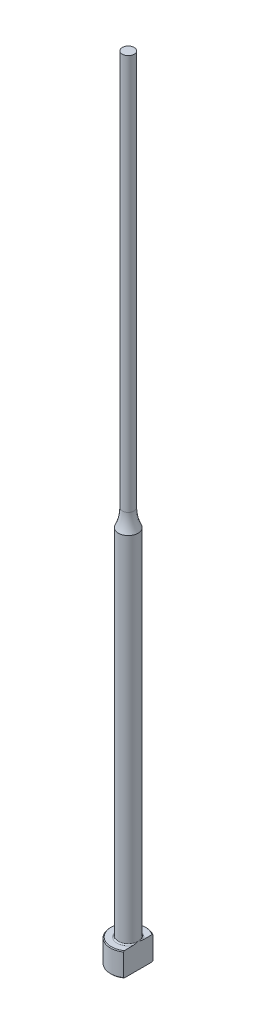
ISO-10303-21;
HEADER;
FILE_DESCRIPTION(('STEP AP214'),'2;1');
FILE_NAME('part.step','',(''),(''),'','','');
FILE_SCHEMA(('AUTOMOTIVE_DESIGN { 1 0 10303 214 1 1 1 1 }'));
ENDSEC;
DATA;
#1=APPLICATION_CONTEXT('core data for automotive mechanical design processes');
#2=APPLICATION_PROTOCOL_DEFINITION('international standard','automotive_design',2000,#1);
#3=PRODUCT_CONTEXT('',#1,'mechanical');
#4=PRODUCT('Part','Part','',(#3));
#5=PRODUCT_RELATED_PRODUCT_CATEGORY('part','',(#4));
#6=PRODUCT_DEFINITION_FORMATION('','',#4);
#7=PRODUCT_DEFINITION_CONTEXT('part definition',#1,'design');
#8=PRODUCT_DEFINITION('design','',#6,#7);
#9=PRODUCT_DEFINITION_SHAPE('','',#8);
#10=(LENGTH_UNIT() NAMED_UNIT(*) SI_UNIT(.MILLI.,.METRE.));
#11=(NAMED_UNIT(*) PLANE_ANGLE_UNIT() SI_UNIT($,.RADIAN.));
#12=(NAMED_UNIT(*) SI_UNIT($,.STERADIAN.) SOLID_ANGLE_UNIT());
#13=UNCERTAINTY_MEASURE_WITH_UNIT(LENGTH_MEASURE(1.E-05),#10,'distance_accuracy_value','');
#14=(GEOMETRIC_REPRESENTATION_CONTEXT(3) GLOBAL_UNCERTAINTY_ASSIGNED_CONTEXT((#13)) GLOBAL_UNIT_ASSIGNED_CONTEXT((#10,
#11,#12)) REPRESENTATION_CONTEXT('',''));
#15=CARTESIAN_POINT('',(0.,0.,0.));
#16=DIRECTION('',(0.,0.,1.));
#17=DIRECTION('',(1.,0.,0.));
#18=AXIS2_PLACEMENT_3D('',#15,#16,#17);
#19=CARTESIAN_POINT('',(-4.49999999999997,6.,0.));
#20=DIRECTION('',(0.,1.,0.));
#21=DIRECTION('',(0.,0.,1.));
#22=AXIS2_PLACEMENT_3D('',#19,#20,#21);
#23=PLANE('',#22);
#24=CARTESIAN_POINT('',(0.,6.,0.));
#25=DIRECTION('',(0.,1.,0.));
#26=DIRECTION('',(0.,0.,1.));
#27=AXIS2_PLACEMENT_3D('',#24,#25,#26);
#28=CIRCLE('',#27,4.3);
#29=CARTESIAN_POINT('',(2.49999999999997,6.,-3.49857113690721));
#30=VERTEX_POINT('',#29);
#31=CARTESIAN_POINT('',(2.49999999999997,6.,3.49857113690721));
#32=VERTEX_POINT('',#31);
#33=EDGE_CURVE('E187',#30,#32,#28,.T.);
#34=ORIENTED_EDGE('',*,*,#33,.T.);
#35=DIRECTION('',(0.,0.,-1.));
#36=VECTOR('',#35,1.);
#37=CARTESIAN_POINT('',(2.49999999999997,6.,0.));
#38=LINE('',#37,#36);
#39=CARTESIAN_POINT('',(2.49999999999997,5.99999999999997,1.26095202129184));
#40=VERTEX_POINT('',#39);
#41=EDGE_CURVE('E57',#32,#40,#38,.T.);
#42=ORIENTED_EDGE('',*,*,#41,.T.);
#43=CARTESIAN_POINT('',(0.,6.,0.));
#44=DIRECTION('',(0.,1.,0.));
#45=DIRECTION('',(0.,0.,1.));
#46=AXIS2_PLACEMENT_3D('',#43,#44,#45);
#47=CIRCLE('',#46,2.79999999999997);
#48=CARTESIAN_POINT('',(2.49999999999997,5.99999999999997,-1.26095202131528));
#49=VERTEX_POINT('',#48);
#50=EDGE_CURVE('E108',#40,#49,#47,.F.);
#51=ORIENTED_EDGE('',*,*,#50,.T.);
#52=EDGE_CURVE('E137',#49,#30,#38,.T.);
#53=ORIENTED_EDGE('',*,*,#52,.T.);
#54=EDGE_LOOP('',(#34,#42,#51,#53));
#55=FACE_BOUND('',#54,.T.);
#56=ADVANCED_FACE('F32',(#55),#23,.T.);
#57=CARTESIAN_POINT('',(0.,259.958771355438,0.));
#58=DIRECTION('',(0.,1.,0.));
#59=DIRECTION('',(0.,0.,1.));
#60=AXIS2_PLACEMENT_3D('',#57,#58,#59);
#61=CYLINDRICAL_SURFACE('',#60,4.49999999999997);
#62=CARTESIAN_POINT('',(0.,5.80000000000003,0.));
#63=DIRECTION('',(0.,1.,0.));
#64=DIRECTION('',(0.,0.,1.));
#65=AXIS2_PLACEMENT_3D('',#62,#63,#64);
#66=CIRCLE('',#65,4.49999999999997);
#67=CARTESIAN_POINT('',(2.49999999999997,5.80000000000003,3.74165738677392));
#68=VERTEX_POINT('',#67);
#69=CARTESIAN_POINT('',(2.49999999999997,5.80000000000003,-3.74165738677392));
#70=VERTEX_POINT('',#69);
#71=EDGE_CURVE('E105',#68,#70,#66,.F.);
#72=ORIENTED_EDGE('',*,*,#71,.T.);
#73=DIRECTION('',(0.,-1.,0.));
#74=VECTOR('',#73,1.);
#75=CARTESIAN_POINT('',(2.49999999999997,200.,-3.74165738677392));
#76=LINE('',#75,#74);
#77=CARTESIAN_POINT('',(2.49999999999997,0.200000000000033,-3.74165738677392));
#78=VERTEX_POINT('',#77);
#79=EDGE_CURVE('E193',#70,#78,#76,.T.);
#80=ORIENTED_EDGE('',*,*,#79,.T.);
#81=CARTESIAN_POINT('',(0.,0.200000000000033,0.));
#82=DIRECTION('',(0.,-1.,0.));
#83=DIRECTION('',(0.,0.,-1.));
#84=AXIS2_PLACEMENT_3D('',#81,#82,#83);
#85=CIRCLE('',#84,4.49999999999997);
#86=CARTESIAN_POINT('',(2.49999999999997,0.200000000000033,3.74165738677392));
#87=VERTEX_POINT('',#86);
#88=EDGE_CURVE('E100',#78,#87,#85,.F.);
#89=ORIENTED_EDGE('',*,*,#88,.T.);
#90=DIRECTION('',(0.,-1.,0.));
#91=VECTOR('',#90,1.);
#92=CARTESIAN_POINT('',(2.49999999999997,200.,3.74165738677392));
#93=LINE('',#92,#91);
#94=EDGE_CURVE('E93',#68,#87,#93,.T.);
#95=ORIENTED_EDGE('',*,*,#94,.F.);
#96=EDGE_LOOP('',(#72,#80,#89,#95));
#97=FACE_BOUND('',#96,.T.);
#98=ADVANCED_FACE('F158',(#97),#61,.T.);
#99=CARTESIAN_POINT('',(0.,0.,0.));
#100=DIRECTION('',(0.,-1.,0.));
#101=DIRECTION('',(0.,0.,-1.));
#102=AXIS2_PLACEMENT_3D('',#99,#100,#101);
#103=PLANE('',#102);
#104=CARTESIAN_POINT('',(0.,0.,0.));
#105=DIRECTION('',(0.,-1.,0.));
#106=DIRECTION('',(0.,0.,-1.));
#107=AXIS2_PLACEMENT_3D('',#104,#105,#106);
#108=CIRCLE('',#107,4.29999999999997);
#109=CARTESIAN_POINT('',(2.49999999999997,0.,3.49857113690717));
#110=VERTEX_POINT('',#109);
#111=CARTESIAN_POINT('',(2.49999999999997,0.,-3.49857113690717));
#112=VERTEX_POINT('',#111);
#113=EDGE_CURVE('E98',#110,#112,#108,.T.);
#114=ORIENTED_EDGE('',*,*,#113,.T.);
#115=DIRECTION('',(0.,0.,1.));
#116=VECTOR('',#115,1.);
#117=CARTESIAN_POINT('',(2.49999999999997,0.,3.74165738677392));
#118=LINE('',#117,#116);
#119=EDGE_CURVE('E83',#112,#110,#118,.T.);
#120=ORIENTED_EDGE('',*,*,#119,.T.);
#121=EDGE_LOOP('',(#114,#120));
#122=FACE_BOUND('',#121,.T.);
#123=ADVANCED_FACE('F103',(#122),#103,.T.);
#124=CARTESIAN_POINT('',(0.,6.00000000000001,0.));
#125=DIRECTION('',(0.,-1.,0.));
#126=DIRECTION('',(0.,0.,-1.));
#127=AXIS2_PLACEMENT_3D('',#124,#125,#126);
#128=CONICAL_SURFACE('',#127,4.3,0.785398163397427);
#129=ORIENTED_EDGE('',*,*,#71,.F.);
#130=CARTESIAN_POINT('',(2.49999999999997,1.69536803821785,8.233449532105));
#131=CARTESIAN_POINT('',(2.49999999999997,1.8415955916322,8.08062583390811));
#132=CARTESIAN_POINT('',(2.49999999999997,1.9876479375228,7.92763429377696));
#133=CARTESIAN_POINT('',(2.49999999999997,2.27932845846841,7.6212454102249));
#134=CARTESIAN_POINT('',(2.49999999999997,2.42495663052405,7.46784806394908));
#135=CARTESIAN_POINT('',(2.49999999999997,2.86116481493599,7.00686753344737));
#136=CARTESIAN_POINT('',(2.49999999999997,3.15099433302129,6.69857321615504));
#137=CARTESIAN_POINT('',(2.49999999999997,3.72884985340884,6.07807253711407));
#138=CARTESIAN_POINT('',(2.49999999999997,4.01686464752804,5.76585569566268));
#139=CARTESIAN_POINT('',(2.49999999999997,4.44539957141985,5.29439081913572));
#140=CARTESIAN_POINT('',(2.49999999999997,4.58765535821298,5.13672163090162));
#141=CARTESIAN_POINT('',(2.49999999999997,4.87066186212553,4.82003964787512));
#142=CARTESIAN_POINT('',(2.49999999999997,5.01141259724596,4.66102686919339));
#143=CARTESIAN_POINT('',(2.49999999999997,5.2957078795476,4.335826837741));
#144=CARTESIAN_POINT('',(2.49999999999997,5.43918418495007,4.16957975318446));
#145=CARTESIAN_POINT('',(2.49999999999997,5.72327592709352,3.83461659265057));
#146=CARTESIAN_POINT('',(2.49999999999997,5.86389099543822,3.66590020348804));
#147=CARTESIAN_POINT('',(2.49999999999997,6.14107420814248,3.32513857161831));
#148=CARTESIAN_POINT('',(2.49999999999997,6.27764223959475,3.15309323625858));
#149=CARTESIAN_POINT('',(2.49999999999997,6.47795110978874,2.89156777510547));
#150=CARTESIAN_POINT('',(2.49999999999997,6.5439576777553,2.80382460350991));
#151=CARTESIAN_POINT('',(2.49999999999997,6.67408242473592,2.62695176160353));
#152=CARTESIAN_POINT('',(2.49999999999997,6.73820069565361,2.53782215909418));
#153=CARTESIAN_POINT('',(2.49999999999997,6.87152528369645,2.34725612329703));
#154=CARTESIAN_POINT('',(2.49999999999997,6.94043579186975,2.24561149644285));
#155=CARTESIAN_POINT('',(2.49999999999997,7.07436956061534,2.03980429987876));
#156=CARTESIAN_POINT('',(2.49999999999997,7.13939350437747,1.93564217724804));
#157=CARTESIAN_POINT('',(2.49999999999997,7.26425850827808,1.72423874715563));
#158=CARTESIAN_POINT('',(2.49999999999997,7.32410048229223,1.61699798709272));
#159=CARTESIAN_POINT('',(2.49999999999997,7.43673687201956,1.39892979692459));
#160=CARTESIAN_POINT('',(2.49999999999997,7.48953435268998,1.28810395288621));
#161=CARTESIAN_POINT('',(2.49999999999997,7.60157711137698,1.02468144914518));
#162=CARTESIAN_POINT('',(2.49999999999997,7.65714985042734,0.870425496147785));
#163=CARTESIAN_POINT('',(2.49999999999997,7.72191807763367,0.634205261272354));
#164=CARTESIAN_POINT('',(2.49999999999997,7.74039604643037,0.55477398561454));
#165=CARTESIAN_POINT('',(2.49999999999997,7.77027635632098,0.39457073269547));
#166=CARTESIAN_POINT('',(2.49999999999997,7.78167951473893,0.313798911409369));
#167=CARTESIAN_POINT('',(2.49999999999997,7.79679993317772,0.150603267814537));
#168=CARTESIAN_POINT('',(2.49999999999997,7.8004286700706,0.0681710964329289));
#169=CARTESIAN_POINT('',(2.49999999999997,7.7994902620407,-0.0966436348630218));
#170=CARTESIAN_POINT('',(2.49999999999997,7.79492331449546,-0.179026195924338));
#171=CARTESIAN_POINT('',(2.49999999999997,7.77788997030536,-0.343090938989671));
#172=CARTESIAN_POINT('',(2.49999999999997,7.76541077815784,-0.424771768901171));
#173=CARTESIAN_POINT('',(2.49999999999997,7.73330588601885,-0.586708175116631));
#174=CARTESIAN_POINT('',(2.49999999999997,7.71367845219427,-0.666963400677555));
#175=CARTESIAN_POINT('',(2.49999999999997,7.65833470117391,-0.860438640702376));
#176=CARTESIAN_POINT('',(2.49999999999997,7.61933642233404,-0.972715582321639));
#177=CARTESIAN_POINT('',(2.49999999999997,7.53162689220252,-1.19338710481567));
#178=CARTESIAN_POINT('',(2.49999999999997,7.4829089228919,-1.30177893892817));
#179=CARTESIAN_POINT('',(2.49999999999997,7.37798916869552,-1.51554087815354));
#180=CARTESIAN_POINT('',(2.49999999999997,7.3217495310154,-1.62089218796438));
#181=CARTESIAN_POINT('',(2.49999999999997,7.23334776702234,-1.77656150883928));
#182=CARTESIAN_POINT('',(2.49999999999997,7.20321149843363,-1.82805098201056));
#183=CARTESIAN_POINT('',(2.49999999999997,7.14176188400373,-1.93032073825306));
#184=CARTESIAN_POINT('',(2.49999999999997,7.11044858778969,-1.98110105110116));
#185=CARTESIAN_POINT('',(2.49999999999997,7.00428706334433,-2.14944611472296));
#186=CARTESIAN_POINT('',(2.49999999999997,6.9271747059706,-2.26558431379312));
#187=CARTESIAN_POINT('',(2.49999999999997,6.76891329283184,-2.49508800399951));
#188=CARTESIAN_POINT('',(2.49999999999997,6.68776326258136,-2.60845281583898));
#189=CARTESIAN_POINT('',(2.49999999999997,6.5223882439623,-2.83304153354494));
#190=CARTESIAN_POINT('',(2.49999999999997,6.43816097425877,-2.94426375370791));
#191=CARTESIAN_POINT('',(2.49999999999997,6.26739791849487,-3.16492607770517));
#192=CARTESIAN_POINT('',(2.49999999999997,6.18086198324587,-3.27436606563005));
#193=CARTESIAN_POINT('',(2.49999999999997,6.00577178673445,-3.49207549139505));
#194=CARTESIAN_POINT('',(2.49999999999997,5.91721294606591,-3.60034123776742));
#195=CARTESIAN_POINT('',(2.49999999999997,5.73865921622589,-3.81568349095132));
#196=CARTESIAN_POINT('',(2.49999999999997,5.64866429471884,-3.92275997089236));
#197=CARTESIAN_POINT('',(2.49999999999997,5.37704561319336,-4.24242567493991));
#198=CARTESIAN_POINT('',(2.49999999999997,5.19370393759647,-4.4535544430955));
#199=CARTESIAN_POINT('',(2.49999999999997,4.82367634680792,-4.87338717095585));
#200=CARTESIAN_POINT('',(2.49999999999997,4.63698598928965,-5.08208719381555));
#201=CARTESIAN_POINT('',(2.49999999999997,4.26138721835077,-5.49751911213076));
#202=CARTESIAN_POINT('',(2.49999999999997,4.07247857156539,-5.70425079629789));
#203=CARTESIAN_POINT('',(2.49999999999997,3.6932962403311,-6.11595801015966));
#204=CARTESIAN_POINT('',(2.49999999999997,3.50302465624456,-6.32093547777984));
#205=CARTESIAN_POINT('',(2.49999999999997,3.12126439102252,-6.72975403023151));
#206=CARTESIAN_POINT('',(2.49999999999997,2.92977570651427,-6.933595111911));
#207=CARTESIAN_POINT('',(2.49999999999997,2.65119470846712,-7.22877144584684));
#208=CARTESIAN_POINT('',(2.49999999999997,2.5644779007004,-7.32046158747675));
#209=CARTESIAN_POINT('',(2.49999999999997,2.39085496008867,-7.50369470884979));
#210=CARTESIAN_POINT('',(2.49999999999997,2.30394879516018,-7.59523765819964));
#211=CARTESIAN_POINT('',(2.49999999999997,2.13016920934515,-7.77797738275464));
#212=CARTESIAN_POINT('',(2.49999999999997,2.04329612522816,-7.8691744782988));
#213=CARTESIAN_POINT('',(2.49999999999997,1.86942568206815,-8.05141764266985));
#214=CARTESIAN_POINT('',(2.49999999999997,1.78242834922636,-8.14246373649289));
#215=CARTESIAN_POINT('',(2.49999999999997,1.69536803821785,-8.233449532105));
#216=B_SPLINE_CURVE_WITH_KNOTS('',3,(#130,#131,#132,#133,#134,#135,#136,#137,#138,#139,#140,
#141,#142,#143,#144,#145,#146,#147,#148,#149,#150,#151,#152,#153,#154,#155,#156,#157,#158,#159,
#160,#161,#162,#163,#164,#165,#166,#167,#168,#169,#170,#171,#172,#173,#174,#175,#176,#177,#178,
#179,#180,#181,#182,#183,#184,#185,#186,#187,#188,#189,#190,#191,#192,#193,#194,#195,#196,#197,
#198,#199,#200,#201,#202,#203,#204,#205,#206,#207,#208,#209,#210,#211,#212,#213,#214,#215),
.UNSPECIFIED.,.F.,.F.,(4,2,2,2,2,2,2,2,2,2,2,2,2,2,2,2,2,2,2,2,2,2,2,2,2,2,2,2,2,2,2,2,2,2,2,2,
2,2,2,2,2,2,4),(0.,0.634537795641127,1.26908006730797,2.53848610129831,3.81276948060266,
4.44983884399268,5.08690057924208,5.74567154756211,6.40452680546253,7.06340042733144,
7.3927766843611,7.72213688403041,8.09047335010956,8.45874487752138,8.82695132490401,
9.19499704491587,9.68515232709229,9.92954493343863,10.1739093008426,10.421041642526,
10.6681680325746,10.915695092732,11.1632822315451,11.5192140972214,11.8753928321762,
12.2334366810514,12.4124062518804,12.5913682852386,13.0094573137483,13.4276477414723,
13.8461547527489,14.2646888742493,14.6842890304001,15.1038986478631,15.942718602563,
16.7827484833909,17.6228675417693,18.4618914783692,19.3009177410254,19.679522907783,
20.0581981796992,20.4360532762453,20.8138378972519),.UNSPECIFIED.);
#217=EDGE_CURVE('E136',#68,#32,#216,.T.);
#218=ORIENTED_EDGE('',*,*,#217,.T.);
#219=ORIENTED_EDGE('',*,*,#33,.F.);
#220=EDGE_CURVE('E128',#30,#70,#216,.T.);
#221=ORIENTED_EDGE('',*,*,#220,.T.);
#222=EDGE_LOOP('',(#129,#218,#219,#221));
#223=FACE_BOUND('',#222,.T.);
#224=ADVANCED_FACE('F144',(#223),#128,.T.);
#225=CARTESIAN_POINT('',(0.,0.200000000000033,0.));
#226=DIRECTION('',(0.,1.,0.));
#227=DIRECTION('',(0.,0.,1.));
#228=AXIS2_PLACEMENT_3D('',#225,#226,#227);
#229=CONICAL_SURFACE('',#228,4.49999999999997,0.785398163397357);
#230=ORIENTED_EDGE('',*,*,#88,.F.);
#231=CARTESIAN_POINT('',(2.49999999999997,4.30463196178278,-8.233449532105));
#232=CARTESIAN_POINT('',(2.49999999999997,4.1584044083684,-8.08062583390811));
#233=CARTESIAN_POINT('',(2.49999999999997,4.01235206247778,-7.92763429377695));
#234=CARTESIAN_POINT('',(2.49999999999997,3.72067154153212,-7.62124541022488));
#235=CARTESIAN_POINT('',(2.49999999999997,3.57504336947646,-7.46784806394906));
#236=CARTESIAN_POINT('',(2.49999999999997,3.13883518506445,-7.00686753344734));
#237=CARTESIAN_POINT('',(2.49999999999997,2.84900566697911,-6.698573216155));
#238=CARTESIAN_POINT('',(2.49999999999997,2.27115014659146,-6.07807253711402));
#239=CARTESIAN_POINT('',(2.49999999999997,1.98313535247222,-5.76585569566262));
#240=CARTESIAN_POINT('',(2.49999999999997,1.55460042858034,-5.29439081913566));
#241=CARTESIAN_POINT('',(2.49999999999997,1.41234464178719,-5.13672163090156));
#242=CARTESIAN_POINT('',(2.49999999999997,1.12933813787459,-4.82003964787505));
#243=CARTESIAN_POINT('',(2.49999999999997,0.988587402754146,-4.66102686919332));
#244=CARTESIAN_POINT('',(2.49999999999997,0.704292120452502,-4.33582683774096));
#245=CARTESIAN_POINT('',(2.49999999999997,0.560815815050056,-4.16957975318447));
#246=CARTESIAN_POINT('',(2.49999999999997,0.276724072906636,-3.83461659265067));
#247=CARTESIAN_POINT('',(2.49999999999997,0.136109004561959,-3.66590020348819));
#248=CARTESIAN_POINT('',(2.49999999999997,-0.141074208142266,-3.32513857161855));
#249=CARTESIAN_POINT('',(2.49999999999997,-0.277642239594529,-3.15309323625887));
#250=CARTESIAN_POINT('',(2.49999999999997,-0.477951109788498,-2.89156777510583));
#251=CARTESIAN_POINT('',(2.49999999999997,-0.54395767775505,-2.8038246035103));
#252=CARTESIAN_POINT('',(2.49999999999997,-0.674082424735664,-2.62695176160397));
#253=CARTESIAN_POINT('',(2.49999999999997,-0.738200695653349,-2.53782215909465));
#254=CARTESIAN_POINT('',(2.49999999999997,-0.871525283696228,-2.34725612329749));
#255=CARTESIAN_POINT('',(2.49999999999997,-0.940435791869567,-2.24561149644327));
#256=CARTESIAN_POINT('',(2.49999999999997,-1.07436956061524,-2.03980429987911));
#257=CARTESIAN_POINT('',(2.49999999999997,-1.13939350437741,-1.93564217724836));
#258=CARTESIAN_POINT('',(2.49999999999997,-1.26425850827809,-1.72423874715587));
#259=CARTESIAN_POINT('',(2.49999999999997,-1.32410048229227,-1.61699798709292));
#260=CARTESIAN_POINT('',(2.49999999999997,-1.43673687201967,-1.39892979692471));
#261=CARTESIAN_POINT('',(2.49999999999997,-1.48953435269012,-1.28810395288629));
#262=CARTESIAN_POINT('',(2.49999999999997,-1.60157711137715,-1.02468144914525));
#263=CARTESIAN_POINT('',(2.49999999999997,-1.6571498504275,-0.870425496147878));
#264=CARTESIAN_POINT('',(2.49999999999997,-1.72191807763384,-0.634205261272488));
#265=CARTESIAN_POINT('',(2.49999999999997,-1.74039604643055,-0.554773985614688));
#266=CARTESIAN_POINT('',(2.49999999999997,-1.77027635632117,-0.394570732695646));
#267=CARTESIAN_POINT('',(2.49999999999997,-1.78167951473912,-0.313798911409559));
#268=CARTESIAN_POINT('',(2.49999999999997,-1.79679993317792,-0.150603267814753));
#269=CARTESIAN_POINT('',(2.49999999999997,-1.80042867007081,-0.0681710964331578));
#270=CARTESIAN_POINT('',(2.49999999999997,-1.79949026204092,0.0966436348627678));
#271=CARTESIAN_POINT('',(2.49999999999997,-1.79492331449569,0.179026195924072));
#272=CARTESIAN_POINT('',(2.49999999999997,-1.77788997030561,0.343090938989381));
#273=CARTESIAN_POINT('',(2.49999999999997,-1.7654107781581,0.42477176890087));
#274=CARTESIAN_POINT('',(2.49999999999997,-1.73330588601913,0.586708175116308));
#275=CARTESIAN_POINT('',(2.49999999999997,-1.71367845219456,0.666963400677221));
#276=CARTESIAN_POINT('',(2.49999999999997,-1.65833470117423,0.860438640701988));
#277=CARTESIAN_POINT('',(2.49999999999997,-1.61933642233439,0.97271558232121));
#278=CARTESIAN_POINT('',(2.49999999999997,-1.53162689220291,1.19338710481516));
#279=CARTESIAN_POINT('',(2.49999999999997,-1.48290892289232,1.30177893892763));
#280=CARTESIAN_POINT('',(2.49999999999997,-1.377989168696,1.51554087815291));
#281=CARTESIAN_POINT('',(2.49999999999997,-1.32174953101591,1.62089218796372));
#282=CARTESIAN_POINT('',(2.49999999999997,-1.23334776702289,1.77656150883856));
#283=CARTESIAN_POINT('',(2.49999999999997,-1.2032114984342,1.82805098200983));
#284=CARTESIAN_POINT('',(2.49999999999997,-1.14176188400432,1.93032073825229));
#285=CARTESIAN_POINT('',(2.49999999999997,-1.1104485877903,1.98110105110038));
#286=CARTESIAN_POINT('',(2.49999999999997,-1.00428706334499,2.1494461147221));
#287=CARTESIAN_POINT('',(2.49999999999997,-0.927174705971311,2.26558431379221));
#288=CARTESIAN_POINT('',(2.49999999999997,-0.768913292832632,2.49508800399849));
#289=CARTESIAN_POINT('',(2.49999999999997,-0.687763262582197,2.60845281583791));
#290=CARTESIAN_POINT('',(2.49999999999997,-0.52238824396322,2.83304153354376));
#291=CARTESIAN_POINT('',(2.49999999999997,-0.43816097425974,2.94426375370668));
#292=CARTESIAN_POINT('',(2.49999999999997,-0.267397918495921,3.16492607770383));
#293=CARTESIAN_POINT('',(2.49999999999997,-0.180861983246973,3.27436606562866));
#294=CARTESIAN_POINT('',(2.49999999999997,-0.00577178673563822,3.49207549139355));
#295=CARTESIAN_POINT('',(2.49999999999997,0.0827870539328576,3.60034123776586));
#296=CARTESIAN_POINT('',(2.49999999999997,0.261340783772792,3.81568349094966));
#297=CARTESIAN_POINT('',(2.49999999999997,0.351335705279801,3.92275997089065));
#298=CARTESIAN_POINT('',(2.49999999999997,0.622954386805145,4.24242567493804));
#299=CARTESIAN_POINT('',(2.49999999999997,0.806296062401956,4.45355444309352));
#300=CARTESIAN_POINT('',(2.49999999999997,1.17632365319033,4.87338717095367));
#301=CARTESIAN_POINT('',(2.49999999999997,1.36301401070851,5.08208719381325));
#302=CARTESIAN_POINT('',(2.49999999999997,1.73861278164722,5.49751911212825));
#303=CARTESIAN_POINT('',(2.49999999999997,1.92752142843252,5.70425079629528));
#304=CARTESIAN_POINT('',(2.49999999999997,2.30670375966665,6.11595801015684));
#305=CARTESIAN_POINT('',(2.49999999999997,2.4969753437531,6.32093547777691));
#306=CARTESIAN_POINT('',(2.49999999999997,2.87873560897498,6.72975403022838));
#307=CARTESIAN_POINT('',(2.49999999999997,3.07022429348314,6.93359511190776));
#308=CARTESIAN_POINT('',(2.49999999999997,3.34880529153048,7.22877144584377));
#309=CARTESIAN_POINT('',(2.49999999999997,3.43552209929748,7.32046158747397));
#310=CARTESIAN_POINT('',(2.49999999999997,3.60914503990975,7.50369470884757));
#311=CARTESIAN_POINT('',(2.49999999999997,3.69605120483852,7.5952376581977));
#312=CARTESIAN_POINT('',(2.49999999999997,3.8698307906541,7.77797738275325));
#313=CARTESIAN_POINT('',(2.49999999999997,3.95670387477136,7.86917447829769));
#314=CARTESIAN_POINT('',(2.49999999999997,4.13057431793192,8.05141764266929));
#315=CARTESIAN_POINT('',(2.49999999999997,4.21757165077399,8.14246373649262));
#316=CARTESIAN_POINT('',(2.49999999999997,4.30463196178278,8.23344953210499));
#317=B_SPLINE_CURVE_WITH_KNOTS('',3,(#231,#232,#233,#234,#235,#236,#237,#238,#239,#240,#241,
#242,#243,#244,#245,#246,#247,#248,#249,#250,#251,#252,#253,#254,#255,#256,#257,#258,#259,#260,
#261,#262,#263,#264,#265,#266,#267,#268,#269,#270,#271,#272,#273,#274,#275,#276,#277,#278,#279,
#280,#281,#282,#283,#284,#285,#286,#287,#288,#289,#290,#291,#292,#293,#294,#295,#296,#297,#298,
#299,#300,#301,#302,#303,#304,#305,#306,#307,#308,#309,#310,#311,#312,#313,#314,#315,#316),
.UNSPECIFIED.,.F.,.F.,(4,2,2,2,2,2,2,2,2,2,2,2,2,2,2,2,2,2,2,2,2,2,2,2,2,2,2,2,2,2,2,2,2,2,2,2,
2,2,2,2,2,2,4),(0.,0.634537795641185,1.26908006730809,2.53848610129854,3.81276948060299,
4.44983884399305,5.08690057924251,5.7456715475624,6.40452680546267,7.06340042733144,
7.39277668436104,7.72213688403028,8.09047335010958,8.45874487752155,8.82695132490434,
9.19499704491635,9.68515232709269,9.92954493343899,10.1739093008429,10.4210416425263,
10.6681680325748,10.9156950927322,11.1632822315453,11.5192140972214,11.8753928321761,
12.2334366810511,12.4124062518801,12.5913682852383,13.0094573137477,13.4276477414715,
13.8461547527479,14.2646888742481,14.6842890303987,15.1038986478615,15.942718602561,
16.7827484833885,17.6228675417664,18.461891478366,19.3009177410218,19.6795229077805,
20.0581981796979,20.4360532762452,20.8138378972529),.UNSPECIFIED.);
#318=EDGE_CURVE('E86',#78,#112,#317,.T.);
#319=ORIENTED_EDGE('',*,*,#318,.T.);
#320=ORIENTED_EDGE('',*,*,#113,.F.);
#321=EDGE_CURVE('E89',#110,#87,#317,.T.);
#322=ORIENTED_EDGE('',*,*,#321,.T.);
#323=EDGE_LOOP('',(#230,#319,#320,#322));
#324=FACE_BOUND('',#323,.T.);
#325=ADVANCED_FACE('F97',(#324),#229,.T.);
#326=CARTESIAN_POINT('',(0.,6.29999999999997,0.));
#327=DIRECTION('',(0.,1.,0.));
#328=DIRECTION('',(0.,0.,1.));
#329=AXIS2_PLACEMENT_3D('',#326,#327,#328);
#330=TOROIDAL_SURFACE('',#329,2.79999999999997,0.3);
#331=CARTESIAN_POINT('',(2.49999999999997,6.29999999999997,0.));
#332=CARTESIAN_POINT('',(2.49999999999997,6.30000062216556,4.84275532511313E-11));
#333=CARTESIAN_POINT('',(2.49999999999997,6.30000124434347,-1.5962096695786E-07));
#334=CARTESIAN_POINT('',(2.49999999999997,6.30000243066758,-6.45477753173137E-07));
#335=CARTESIAN_POINT('',(2.49999999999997,6.30000299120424,-9.78480435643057E-07));
#336=CARTESIAN_POINT('',(2.49999999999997,6.30000411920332,-1.77471942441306E-06));
#337=CARTESIAN_POINT('',(2.49999999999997,6.30000467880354,-2.24902099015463E-06));
#338=CARTESIAN_POINT('',(2.49999999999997,6.30000572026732,-3.25953628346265E-06));
#339=CARTESIAN_POINT('',(2.49999999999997,6.30000620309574,-3.7948069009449E-06));
#340=CARTESIAN_POINT('',(2.49999999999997,6.30000787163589,-5.75794556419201E-06));
#341=CARTESIAN_POINT('',(2.49999999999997,6.3000089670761,-7.26424030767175E-06));
#342=CARTESIAN_POINT('',(2.49999999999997,6.30001087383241,-1.03361121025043E-05));
#343=CARTESIAN_POINT('',(2.49999999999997,6.30001169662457,-1.1894949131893E-05));
#344=CARTESIAN_POINT('',(2.49999999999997,6.30001489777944,-1.81400839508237E-05));
#345=CARTESIAN_POINT('',(2.49999999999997,6.30001712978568,-2.29062162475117E-05));
#346=CARTESIAN_POINT('',(2.49999999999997,6.30002067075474,-3.21793848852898E-05));
#347=CARTESIAN_POINT('',(2.49999999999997,6.30002205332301,-3.66588971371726E-05));
#348=CARTESIAN_POINT('',(2.49999999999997,6.30002810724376,-5.61718377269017E-05));
#349=CARTESIAN_POINT('',(2.49999999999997,6.30003284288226,-7.11735829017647E-05));
#350=CARTESIAN_POINT('',(2.49999999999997,6.30004025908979,-9.89920283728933E-05));
#351=CARTESIAN_POINT('',(2.49999999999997,6.30004315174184,-0.000111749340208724));
#352=CARTESIAN_POINT('',(2.49999999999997,6.30006652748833,-0.000206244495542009));
#353=CARTESIAN_POINT('',(2.49999999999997,6.30009698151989,-0.000285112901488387));
#354=CARTESIAN_POINT('',(2.49999999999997,6.30021213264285,-0.000594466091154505));
#355=CARTESIAN_POINT('',(2.49999999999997,6.30028938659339,-0.000826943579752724));
#356=CARTESIAN_POINT('',(2.49999999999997,6.30059681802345,-0.0017388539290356));
#357=CARTESIAN_POINT('',(2.49999999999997,6.3008347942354,-0.00241625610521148));
#358=CARTESIAN_POINT('',(2.49999999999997,6.30181198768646,-0.00521069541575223));
#359=CARTESIAN_POINT('',(2.49999999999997,6.30254240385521,-0.00732996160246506));
#360=CARTESIAN_POINT('',(2.49999999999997,6.31226043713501,-0.0355096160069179));
#361=CARTESIAN_POINT('',(2.49999999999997,6.32130808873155,-0.0615551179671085));
#362=CARTESIAN_POINT('',(2.49999999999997,6.33896212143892,-0.112677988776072));
#363=CARTESIAN_POINT('',(2.49999999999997,6.34757212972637,-0.137754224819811));
#364=CARTESIAN_POINT('',(2.49999999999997,6.36573068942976,-0.190981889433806));
#365=CARTESIAN_POINT('',(2.49999999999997,6.37526654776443,-0.219137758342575));
#366=CARTESIAN_POINT('',(2.49999999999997,6.3942286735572,-0.275816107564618));
#367=CARTESIAN_POINT('',(2.49999999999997,6.40365272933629,-0.304339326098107));
#368=CARTESIAN_POINT('',(2.49999999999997,6.42641697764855,-0.374416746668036));
#369=CARTESIAN_POINT('',(2.49999999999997,6.43959811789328,-0.416023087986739));
#370=CARTESIAN_POINT('',(2.49999999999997,6.46479157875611,-0.49848190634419));
#371=CARTESIAN_POINT('',(2.49999999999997,6.47682455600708,-0.539328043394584));
#372=CARTESIAN_POINT('',(2.49999999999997,6.50224427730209,-0.62998152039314));
#373=CARTESIAN_POINT('',(2.49999999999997,6.51538048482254,-0.679860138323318));
#374=CARTESIAN_POINT('',(2.49999999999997,6.53964074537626,-0.780511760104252));
#375=CARTESIAN_POINT('',(2.49999999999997,6.55074877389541,-0.831288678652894));
#376=CARTESIAN_POINT('',(2.49999999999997,6.57087054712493,-0.937063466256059));
#377=CARTESIAN_POINT('',(2.49999999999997,6.57967623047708,-0.992102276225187));
#378=CARTESIAN_POINT('',(2.49999999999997,6.59301148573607,-1.10256024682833));
#379=CARTESIAN_POINT('',(2.49999999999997,6.59755297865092,-1.1579779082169));
#380=CARTESIAN_POINT('',(2.49999999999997,6.60093314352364,-1.26786705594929));
#381=CARTESIAN_POINT('',(2.49999999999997,6.59989366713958,-1.32233291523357));
#382=CARTESIAN_POINT('',(2.49999999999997,6.59277279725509,-1.40310062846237));
#383=CARTESIAN_POINT('',(2.49999999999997,6.58952137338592,-1.42965222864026));
#384=CARTESIAN_POINT('',(2.49999999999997,6.58085857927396,-1.48239078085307));
#385=CARTESIAN_POINT('',(2.49999999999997,6.57544928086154,-1.50857805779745));
#386=CARTESIAN_POINT('',(2.49999999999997,6.56298810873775,-1.5565879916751));
#387=CARTESIAN_POINT('',(2.49999999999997,6.55628200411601,-1.57849902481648));
#388=CARTESIAN_POINT('',(2.49999999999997,6.54055393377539,-1.62160292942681));
#389=CARTESIAN_POINT('',(2.49999999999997,6.53152220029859,-1.64279233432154));
#390=CARTESIAN_POINT('',(2.49999999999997,6.51057199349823,-1.68404469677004));
#391=CARTESIAN_POINT('',(2.49999999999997,6.49862012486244,-1.7040910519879));
#392=CARTESIAN_POINT('',(2.49999999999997,6.47134074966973,-1.74172093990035));
#393=CARTESIAN_POINT('',(2.49999999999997,6.45603127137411,-1.75931683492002));
#394=CARTESIAN_POINT('',(2.49999999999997,6.42979930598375,-1.78297070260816));
#395=CARTESIAN_POINT('',(2.49999999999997,6.42024268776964,-1.79054141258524));
#396=CARTESIAN_POINT('',(2.49999999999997,6.40009035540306,-1.80416997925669));
#397=CARTESIAN_POINT('',(2.49999999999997,6.38949499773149,-1.8102283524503));
#398=CARTESIAN_POINT('',(2.49999999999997,6.36727740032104,-1.82047087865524));
#399=CARTESIAN_POINT('',(2.49999999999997,6.35564531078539,-1.82463409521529));
#400=CARTESIAN_POINT('',(2.49999999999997,6.33178837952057,-1.83058442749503));
#401=CARTESIAN_POINT('',(2.49999999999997,6.31956435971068,-1.83237474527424));
#402=CARTESIAN_POINT('',(2.49999999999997,6.29665736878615,-1.83331852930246));
#403=CARTESIAN_POINT('',(2.49999999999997,6.28598670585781,-1.83279233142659));
#404=CARTESIAN_POINT('',(2.49999999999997,6.26490749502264,-1.82986307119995));
#405=CARTESIAN_POINT('',(2.49999999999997,6.25449899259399,-1.82745968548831));
#406=CARTESIAN_POINT('',(2.49999999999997,6.23467098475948,-1.8211125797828));
#407=CARTESIAN_POINT('',(2.49999999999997,6.22522816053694,-1.81724026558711));
#408=CARTESIAN_POINT('',(2.49999999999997,6.20699535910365,-1.80819497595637));
#409=CARTESIAN_POINT('',(2.49999999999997,6.19820556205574,-1.80302164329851));
#410=CARTESIAN_POINT('',(2.49999999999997,6.17663162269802,-1.7884211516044));
#411=CARTESIAN_POINT('',(2.49999999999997,6.16436228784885,-1.77823293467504));
#412=CARTESIAN_POINT('',(2.49999999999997,6.14157828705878,-1.75604629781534));
#413=CARTESIAN_POINT('',(2.49999999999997,6.13106906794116,-1.7440424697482));
#414=CARTESIAN_POINT('',(2.49999999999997,6.10600520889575,-1.71142114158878));
#415=CARTESIAN_POINT('',(2.49999999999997,6.09267476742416,-1.68986887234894));
#416=CARTESIAN_POINT('',(2.49999999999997,6.06940323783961,-1.64508572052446));
#417=CARTESIAN_POINT('',(2.49999999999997,6.05946314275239,-1.62185434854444));
#418=CARTESIAN_POINT('',(2.49999999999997,6.03545750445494,-1.55546754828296));
#419=CARTESIAN_POINT('',(2.49999999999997,6.02444022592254,-1.51122187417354));
#420=CARTESIAN_POINT('',(2.49999999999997,6.00863926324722,-1.42119777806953));
#421=CARTESIAN_POINT('',(2.49999999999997,6.00393876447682,-1.3754068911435));
#422=CARTESIAN_POINT('',(2.49999999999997,5.99924212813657,-1.28072198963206));
#423=CARTESIAN_POINT('',(2.49999999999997,5.99956098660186,-1.23181420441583));
#424=CARTESIAN_POINT('',(2.49999999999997,6.00436098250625,-1.13410944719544));
#425=CARTESIAN_POINT('',(2.49999999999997,6.00885327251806,-1.08531312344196));
#426=CARTESIAN_POINT('',(2.49999999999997,6.02074191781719,-0.990773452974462));
#427=CARTESIAN_POINT('',(2.49999999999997,6.02796792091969,-0.945007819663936));
#428=CARTESIAN_POINT('',(2.49999999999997,6.04465555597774,-0.854199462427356));
#429=CARTESIAN_POINT('',(2.49999999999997,6.05410250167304,-0.809153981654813));
#430=CARTESIAN_POINT('',(2.49999999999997,6.0771002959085,-0.709411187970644));
#431=CARTESIAN_POINT('',(2.49999999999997,6.09109633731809,-0.654817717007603));
#432=CARTESIAN_POINT('',(2.49999999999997,6.12140740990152,-0.544863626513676));
#433=CARTESIAN_POINT('',(2.49999999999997,6.13777040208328,-0.489516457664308));
#434=CARTESIAN_POINT('',(2.49999999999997,6.1664954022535,-0.396740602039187));
#435=CARTESIAN_POINT('',(2.49999999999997,6.17848130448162,-0.359193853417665));
#436=CARTESIAN_POINT('',(2.49999999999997,6.2028050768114,-0.284651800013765));
#437=CARTESIAN_POINT('',(2.49999999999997,6.21513791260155,-0.247654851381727));
#438=CARTESIAN_POINT('',(2.49999999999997,6.23873713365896,-0.177767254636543));
#439=CARTESIAN_POINT('',(2.49999999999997,6.24997409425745,-0.144866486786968));
#440=CARTESIAN_POINT('',(2.49999999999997,6.27307149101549,-0.0777985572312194));
#441=CARTESIAN_POINT('',(2.49999999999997,6.28493883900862,-0.0436336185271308));
#442=CARTESIAN_POINT('',(2.49999999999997,6.29745794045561,-0.00732879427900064));
#443=CARTESIAN_POINT('',(2.49999999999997,6.29818879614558,-0.00520838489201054));
#444=CARTESIAN_POINT('',(2.49999999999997,6.29916610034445,-0.00241367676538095));
#445=CARTESIAN_POINT('',(2.49999999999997,6.29940376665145,-0.00173715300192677));
#446=CARTESIAN_POINT('',(2.49999999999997,6.29971082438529,-0.00082635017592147));
#447=CARTESIAN_POINT('',(2.49999999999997,6.29978800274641,-0.000594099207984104));
#448=CARTESIAN_POINT('',(2.49999999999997,6.2999030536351,-0.000285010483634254));
#449=CARTESIAN_POINT('',(2.49999999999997,6.29993349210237,-0.000206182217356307));
#450=CARTESIAN_POINT('',(2.49999999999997,6.29995685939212,-0.000111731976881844));
#451=CARTESIAN_POINT('',(2.49999999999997,6.29995975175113,-9.89774273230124E-05));
#452=CARTESIAN_POINT('',(2.49999999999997,6.29996716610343,-7.11651841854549E-05));
#453=CARTESIAN_POINT('',(2.49999999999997,6.29997189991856,-5.61668063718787E-05));
#454=CARTESIAN_POINT('',(2.49999999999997,6.29997795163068,-3.665763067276E-05));
#455=CARTESIAN_POINT('',(2.49999999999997,6.29997933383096,-3.21785222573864E-05));
#456=CARTESIAN_POINT('',(2.49999999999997,6.29998287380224,-2.29061355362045E-05));
#457=CARTESIAN_POINT('',(2.49999999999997,6.29998510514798,-1.81403645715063E-05));
#458=CARTESIAN_POINT('',(2.49999999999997,6.29998830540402,-1.18955812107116E-05));
#459=CARTESIAN_POINT('',(2.49999999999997,6.29998912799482,-1.03367751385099E-05));
#460=CARTESIAN_POINT('',(2.49999999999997,6.29999103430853,-7.26492687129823E-06));
#461=CARTESIAN_POINT('',(2.49999999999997,6.29999212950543,-5.75862197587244E-06));
#462=CARTESIAN_POINT('',(2.49999999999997,6.29999379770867,-3.79542406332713E-06));
#463=CARTESIAN_POINT('',(2.49999999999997,6.29999428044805,-3.26012700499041E-06));
#464=CARTESIAN_POINT('',(2.49999999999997,6.29999532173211,-2.2495428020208E-06));
#465=CARTESIAN_POINT('',(2.49999999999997,6.29999588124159,-1.77519849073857E-06));
#466=CARTESIAN_POINT('',(2.49999999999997,6.29999700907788,-9.7885677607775E-07));
#467=CARTESIAN_POINT('',(2.49999999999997,6.29999756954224,-6.45796805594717E-07));
#468=CARTESIAN_POINT('',(2.49999999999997,6.29999875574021,-1.59799505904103E-07));
#469=CARTESIAN_POINT('',(2.49999999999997,6.29999937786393,-4.84252538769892E-11));
#470=CARTESIAN_POINT('',(2.49999999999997,6.29999999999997,0.));
#471=B_SPLINE_CURVE_WITH_KNOTS('',3,(#331,#332,#333,#334,#335,#336,#337,#338,#339,#340,#341,
#342,#343,#344,#345,#346,#347,#348,#349,#350,#351,#352,#353,#354,#355,#356,#357,#358,#359,#360,
#361,#362,#363,#364,#365,#366,#367,#368,#369,#370,#371,#372,#373,#374,#375,#376,#377,#378,#379,
#380,#381,#382,#383,#384,#385,#386,#387,#388,#389,#390,#391,#392,#393,#394,#395,#396,#397,#398,
#399,#400,#401,#402,#403,#404,#405,#406,#407,#408,#409,#410,#411,#412,#413,#414,#415,#416,#417,
#418,#419,#420,#421,#422,#423,#424,#425,#426,#427,#428,#429,#430,#431,#432,#433,#434,#435,#436,
#437,#438,#439,#440,#441,#442,#443,#444,#445,#446,#447,#448,#449,#450,#451,#452,#453,#454,#455,
#456,#457,#458,#459,#460,#461,#462,#463,#464,#465,#466,#467,#468,#469,#470),.UNSPECIFIED.,.T.,
.F.,(4,2,2,2,2,2,2,2,2,2,2,2,2,2,2,2,2,2,2,2,2,2,2,2,2,2,2,2,2,2,2,2,2,2,2,2,2,2,2,2,2,2,2,2,2,
2,2,2,2,2,2,2,2,2,2,2,2,2,2,2,2,2,2,2,2,2,2,2,2,4),(0.,1.86789324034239E-06,
3.81549782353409E-06,6.00610697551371E-06,8.16653256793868E-06,1.37285624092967E-05,
1.90122213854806E-05,3.47597333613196E-05,4.88082673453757E-05,9.59978487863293E-05,
0.000135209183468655,0.000388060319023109,0.00112364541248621,0.00327678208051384,
0.0100024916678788,0.0927120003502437,0.172253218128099,0.261432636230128,0.351551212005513,
0.48247714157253,0.610212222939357,0.764915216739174,0.920792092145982,1.08787897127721,
1.25449733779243,1.41749285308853,1.49767530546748,1.57778095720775,1.64642481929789,
1.7153618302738,1.7851275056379,1.8545273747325,1.89099315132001,1.92744645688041,
1.96429324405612,2.00109025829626,2.03297105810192,2.06485735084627,2.09535926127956,
2.1258695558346,2.17344034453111,2.22115572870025,2.29675134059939,2.37236907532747,
2.50839721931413,2.64619971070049,2.79268284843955,2.93955855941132,3.07848421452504,
3.21651583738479,3.38554045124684,3.55865938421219,3.67689643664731,3.79388863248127,
3.8981908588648,4.00668323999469,4.01341261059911,4.01556295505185,4.01629782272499,
4.0165505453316,4.01658974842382,4.01663692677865,4.01665097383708,4.01666671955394,
4.01667200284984,4.01667756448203,4.01667972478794,4.01668191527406,4.0166838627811,
4.01668573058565),.UNSPECIFIED.);
#472=CARTESIAN_POINT('',(2.49999999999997,6.29999999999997,0.));
#473=VERTEX_POINT('',#472);
#474=EDGE_CURVE('E11',#49,#473,#471,.T.);
#475=ORIENTED_EDGE('',*,*,#474,.F.);
#476=ORIENTED_EDGE('',*,*,#50,.F.);
#477=CARTESIAN_POINT('',(2.49999999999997,6.29999999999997,0.));
#478=CARTESIAN_POINT('',(2.49999999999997,6.29999937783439,-4.84275513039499E-11));
#479=CARTESIAN_POINT('',(2.49999999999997,6.29999875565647,1.59620966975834E-07));
#480=CARTESIAN_POINT('',(2.49999999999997,6.29999756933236,6.45477753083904E-07));
#481=CARTESIAN_POINT('',(2.49999999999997,6.2999970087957,9.78480435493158E-07));
#482=CARTESIAN_POINT('',(2.49999999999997,6.29999588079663,1.77471942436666E-06));
#483=CARTESIAN_POINT('',(2.49999999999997,6.29999532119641,2.24902099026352E-06));
#484=CARTESIAN_POINT('',(2.49999999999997,6.29999427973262,3.25953628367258E-06));
#485=CARTESIAN_POINT('',(2.49999999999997,6.2999937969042,3.79480690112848E-06));
#486=CARTESIAN_POINT('',(2.49999999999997,6.29999212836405,5.75794556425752E-06));
#487=CARTESIAN_POINT('',(2.49999999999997,6.29999103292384,7.2642403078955E-06));
#488=CARTESIAN_POINT('',(2.49999999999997,6.29998912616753,1.03361121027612E-05));
#489=CARTESIAN_POINT('',(2.49999999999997,6.29998830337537,1.18949491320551E-05));
#490=CARTESIAN_POINT('',(2.49999999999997,6.2999851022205,1.81400839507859E-05));
#491=CARTESIAN_POINT('',(2.49999999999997,6.29998287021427,2.29062162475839E-05));
#492=CARTESIAN_POINT('',(2.49999999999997,6.29997932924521,3.21793848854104E-05));
#493=CARTESIAN_POINT('',(2.49999999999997,6.29997794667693,3.66588971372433E-05));
#494=CARTESIAN_POINT('',(2.49999999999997,6.29997189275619,5.61718377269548E-05));
#495=CARTESIAN_POINT('',(2.49999999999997,6.29996715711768,7.11735829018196E-05));
#496=CARTESIAN_POINT('',(2.49999999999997,6.29995974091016,9.89920283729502E-05));
#497=CARTESIAN_POINT('',(2.49999999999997,6.2999568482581,0.000111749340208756));
#498=CARTESIAN_POINT('',(2.49999999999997,6.29993347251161,0.000206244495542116));
#499=CARTESIAN_POINT('',(2.49999999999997,6.29990301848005,0.00028511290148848));
#500=CARTESIAN_POINT('',(2.49999999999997,6.2997878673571,0.000594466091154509));
#501=CARTESIAN_POINT('',(2.49999999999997,6.29971061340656,0.000826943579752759));
#502=CARTESIAN_POINT('',(2.49999999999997,6.29940318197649,0.00173885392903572));
#503=CARTESIAN_POINT('',(2.49999999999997,6.29916520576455,0.00241625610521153));
#504=CARTESIAN_POINT('',(2.49999999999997,6.29818801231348,0.00521069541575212));
#505=CARTESIAN_POINT('',(2.49999999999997,6.29745759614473,0.00732996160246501));
#506=CARTESIAN_POINT('',(2.49999999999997,6.28773956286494,0.0355096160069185));
#507=CARTESIAN_POINT('',(2.49999999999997,6.27869191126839,0.0615551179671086));
#508=CARTESIAN_POINT('',(2.49999999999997,6.26103787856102,0.112677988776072));
#509=CARTESIAN_POINT('',(2.49999999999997,6.25242787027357,0.137754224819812));
#510=CARTESIAN_POINT('',(2.49999999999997,6.23426931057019,0.190981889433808));
#511=CARTESIAN_POINT('',(2.49999999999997,6.22473345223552,0.219137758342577));
#512=CARTESIAN_POINT('',(2.49999999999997,6.20577132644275,0.275816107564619));
#513=CARTESIAN_POINT('',(2.49999999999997,6.19634727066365,0.304339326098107));
#514=CARTESIAN_POINT('',(2.49999999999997,6.17358302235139,0.374416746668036));
#515=CARTESIAN_POINT('',(2.49999999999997,6.16040188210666,0.416023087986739));
#516=CARTESIAN_POINT('',(2.49999999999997,6.13520842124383,0.498481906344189));
#517=CARTESIAN_POINT('',(2.49999999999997,6.12317544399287,0.539328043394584));
#518=CARTESIAN_POINT('',(2.49999999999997,6.09775572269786,0.62998152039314));
#519=CARTESIAN_POINT('',(2.49999999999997,6.0846195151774,0.679860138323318));
#520=CARTESIAN_POINT('',(2.49999999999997,6.06035925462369,0.780511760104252));
#521=CARTESIAN_POINT('',(2.49999999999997,6.04925122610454,0.831288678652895));
#522=CARTESIAN_POINT('',(2.49999999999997,6.02912945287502,0.937063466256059));
#523=CARTESIAN_POINT('',(2.49999999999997,6.02032376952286,0.992102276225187));
#524=CARTESIAN_POINT('',(2.49999999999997,6.00698851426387,1.10256024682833));
#525=CARTESIAN_POINT('',(2.49999999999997,6.00244702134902,1.1579779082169));
#526=CARTESIAN_POINT('',(2.49999999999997,5.9990668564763,1.26786705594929));
#527=CARTESIAN_POINT('',(2.49999999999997,6.00010633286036,1.32233291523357));
#528=CARTESIAN_POINT('',(2.49999999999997,6.00722720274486,1.40310062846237));
#529=CARTESIAN_POINT('',(2.49999999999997,6.01047862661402,1.42965222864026));
#530=CARTESIAN_POINT('',(2.49999999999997,6.01914142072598,1.48239078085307));
#531=CARTESIAN_POINT('',(2.49999999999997,6.02455071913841,1.50857805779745));
#532=CARTESIAN_POINT('',(2.49999999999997,6.0370118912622,1.5565879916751));
#533=CARTESIAN_POINT('',(2.49999999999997,6.04371799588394,1.57849902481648));
#534=CARTESIAN_POINT('',(2.49999999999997,6.05944606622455,1.62160292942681));
#535=CARTESIAN_POINT('',(2.49999999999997,6.06847779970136,1.64279233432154));
#536=CARTESIAN_POINT('',(2.49999999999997,6.08942800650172,1.68404469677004));
#537=CARTESIAN_POINT('',(2.49999999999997,6.1013798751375,1.7040910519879));
#538=CARTESIAN_POINT('',(2.49999999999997,6.12865925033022,1.74172093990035));
#539=CARTESIAN_POINT('',(2.49999999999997,6.14396872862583,1.75931683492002));
#540=CARTESIAN_POINT('',(2.49999999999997,6.17020069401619,1.78297070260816));
#541=CARTESIAN_POINT('',(2.49999999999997,6.17975731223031,1.79054141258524));
#542=CARTESIAN_POINT('',(2.49999999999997,6.19990964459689,1.80416997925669));
#543=CARTESIAN_POINT('',(2.49999999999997,6.21050500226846,1.8102283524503));
#544=CARTESIAN_POINT('',(2.49999999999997,6.2327225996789,1.82047087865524));
#545=CARTESIAN_POINT('',(2.49999999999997,6.24435468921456,1.82463409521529));
#546=CARTESIAN_POINT('',(2.49999999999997,6.26821162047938,1.83058442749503));
#547=CARTESIAN_POINT('',(2.49999999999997,6.28043564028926,1.83237474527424));
#548=CARTESIAN_POINT('',(2.49999999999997,6.30334263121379,1.83331852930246));
#549=CARTESIAN_POINT('',(2.49999999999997,6.31401329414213,1.83279233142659));
#550=CARTESIAN_POINT('',(2.49999999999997,6.3350925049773,1.82986307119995));
#551=CARTESIAN_POINT('',(2.49999999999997,6.34550100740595,1.82745968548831));
#552=CARTESIAN_POINT('',(2.49999999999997,6.36532901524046,1.8211125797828));
#553=CARTESIAN_POINT('',(2.49999999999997,6.37477183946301,1.81724026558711));
#554=CARTESIAN_POINT('',(2.49999999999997,6.39300464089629,1.80819497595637));
#555=CARTESIAN_POINT('',(2.49999999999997,6.4017944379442,1.80302164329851));
#556=CARTESIAN_POINT('',(2.49999999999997,6.42336837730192,1.7884211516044));
#557=CARTESIAN_POINT('',(2.49999999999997,6.4356377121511,1.77823293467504));
#558=CARTESIAN_POINT('',(2.49999999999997,6.45842171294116,1.75604629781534));
#559=CARTESIAN_POINT('',(2.49999999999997,6.46893093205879,1.7440424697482));
#560=CARTESIAN_POINT('',(2.49999999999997,6.4939947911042,1.71142114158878));
#561=CARTESIAN_POINT('',(2.49999999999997,6.50732523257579,1.68986887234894));
#562=CARTESIAN_POINT('',(2.49999999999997,6.53059676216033,1.64508572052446));
#563=CARTESIAN_POINT('',(2.49999999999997,6.54053685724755,1.62185434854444));
#564=CARTESIAN_POINT('',(2.49999999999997,6.564542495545,1.55546754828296));
#565=CARTESIAN_POINT('',(2.49999999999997,6.57555977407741,1.51122187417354));
#566=CARTESIAN_POINT('',(2.49999999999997,6.59136073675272,1.42119777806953));
#567=CARTESIAN_POINT('',(2.49999999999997,6.59606123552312,1.3754068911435));
#568=CARTESIAN_POINT('',(2.49999999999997,6.60075787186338,1.28072198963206));
#569=CARTESIAN_POINT('',(2.49999999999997,6.60043901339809,1.23181420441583));
#570=CARTESIAN_POINT('',(2.49999999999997,6.59563901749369,1.13410944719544));
#571=CARTESIAN_POINT('',(2.49999999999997,6.59114672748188,1.08531312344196));
#572=CARTESIAN_POINT('',(2.49999999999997,6.57925808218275,0.990773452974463));
#573=CARTESIAN_POINT('',(2.49999999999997,6.57203207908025,0.945007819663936));
#574=CARTESIAN_POINT('',(2.49999999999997,6.55534444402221,0.854199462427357));
#575=CARTESIAN_POINT('',(2.49999999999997,6.54589749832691,0.809153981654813));
#576=CARTESIAN_POINT('',(2.49999999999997,6.52289970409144,0.709411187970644));
#577=CARTESIAN_POINT('',(2.49999999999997,6.50890366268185,0.654817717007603));
#578=CARTESIAN_POINT('',(2.49999999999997,6.47859259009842,0.544863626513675));
#579=CARTESIAN_POINT('',(2.49999999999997,6.46222959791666,0.489516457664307));
#580=CARTESIAN_POINT('',(2.49999999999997,6.43350459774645,0.396740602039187));
#581=CARTESIAN_POINT('',(2.49999999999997,6.42151869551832,0.359193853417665));
#582=CARTESIAN_POINT('',(2.49999999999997,6.39719492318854,0.284651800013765));
#583=CARTESIAN_POINT('',(2.49999999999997,6.38486208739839,0.247654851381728));
#584=CARTESIAN_POINT('',(2.49999999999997,6.36126286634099,0.177767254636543));
#585=CARTESIAN_POINT('',(2.49999999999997,6.35002590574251,0.144866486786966));
#586=CARTESIAN_POINT('',(2.49999999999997,6.32692850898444,0.077798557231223));
#587=CARTESIAN_POINT('',(2.49999999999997,6.31506116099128,0.0436336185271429));
#588=CARTESIAN_POINT('',(2.49999999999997,6.30254205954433,0.00732879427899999));
#589=CARTESIAN_POINT('',(2.49999999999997,6.30181120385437,0.00520838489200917));
#590=CARTESIAN_POINT('',(2.49999999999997,6.30083389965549,0.00241367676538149));
#591=CARTESIAN_POINT('',(2.49999999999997,6.30059623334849,0.00173715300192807));
#592=CARTESIAN_POINT('',(2.49999999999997,6.30028917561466,0.000826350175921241));
#593=CARTESIAN_POINT('',(2.49999999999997,6.30021199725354,0.000594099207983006));
#594=CARTESIAN_POINT('',(2.49999999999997,6.30009694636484,0.000285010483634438));
#595=CARTESIAN_POINT('',(2.49999999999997,6.30006650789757,0.000206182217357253));
#596=CARTESIAN_POINT('',(2.49999999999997,6.30004314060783,0.000111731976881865));
#597=CARTESIAN_POINT('',(2.49999999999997,6.30004024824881,9.8977427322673E-05));
#598=CARTESIAN_POINT('',(2.49999999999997,6.30003283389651,7.11651841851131E-05));
#599=CARTESIAN_POINT('',(2.49999999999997,6.30002810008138,5.61668063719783E-05));
#600=CARTESIAN_POINT('',(2.49999999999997,6.30002204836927,3.66576306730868E-05));
#601=CARTESIAN_POINT('',(2.49999999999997,6.30002066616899,3.21785222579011E-05));
#602=CARTESIAN_POINT('',(2.49999999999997,6.30001712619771,2.29061355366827E-05));
#603=CARTESIAN_POINT('',(2.49999999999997,6.30001489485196,1.81403645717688E-05));
#604=CARTESIAN_POINT('',(2.49999999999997,6.30001169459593,1.18955812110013E-05));
#605=CARTESIAN_POINT('',(2.49999999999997,6.30001087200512,1.03367751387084E-05));
#606=CARTESIAN_POINT('',(2.49999999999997,6.30000896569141,7.26492687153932E-06));
#607=CARTESIAN_POINT('',(2.49999999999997,6.30000787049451,5.75862197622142E-06));
#608=CARTESIAN_POINT('',(2.49999999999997,6.30000620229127,3.79542406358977E-06));
#609=CARTESIAN_POINT('',(2.49999999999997,6.30000571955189,3.26012700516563E-06));
#610=CARTESIAN_POINT('',(2.49999999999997,6.30000467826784,2.24954280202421E-06));
#611=CARTESIAN_POINT('',(2.49999999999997,6.30000411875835,1.77519849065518E-06));
#612=CARTESIAN_POINT('',(2.49999999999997,6.30000299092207,9.78856775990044E-07));
#613=CARTESIAN_POINT('',(2.49999999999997,6.3000024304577,6.45796805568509E-07));
#614=CARTESIAN_POINT('',(2.49999999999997,6.30000124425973,1.5979950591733E-07));
#615=CARTESIAN_POINT('',(2.49999999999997,6.30000062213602,4.84252519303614E-11));
#616=CARTESIAN_POINT('',(2.49999999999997,6.29999999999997,0.));
#617=B_SPLINE_CURVE_WITH_KNOTS('',3,(#477,#478,#479,#480,#481,#482,#483,#484,#485,#486,#487,
#488,#489,#490,#491,#492,#493,#494,#495,#496,#497,#498,#499,#500,#501,#502,#503,#504,#505,#506,
#507,#508,#509,#510,#511,#512,#513,#514,#515,#516,#517,#518,#519,#520,#521,#522,#523,#524,#525,
#526,#527,#528,#529,#530,#531,#532,#533,#534,#535,#536,#537,#538,#539,#540,#541,#542,#543,#544,
#545,#546,#547,#548,#549,#550,#551,#552,#553,#554,#555,#556,#557,#558,#559,#560,#561,#562,#563,
#564,#565,#566,#567,#568,#569,#570,#571,#572,#573,#574,#575,#576,#577,#578,#579,#580,#581,#582,
#583,#584,#585,#586,#587,#588,#589,#590,#591,#592,#593,#594,#595,#596,#597,#598,#599,#600,#601,
#602,#603,#604,#605,#606,#607,#608,#609,#610,#611,#612,#613,#614,#615,#616),.UNSPECIFIED.,.T.,
.F.,(4,2,2,2,2,2,2,2,2,2,2,2,2,2,2,2,2,2,2,2,2,2,2,2,2,2,2,2,2,2,2,2,2,2,2,2,2,2,2,2,2,2,2,2,2,
2,2,2,2,2,2,2,2,2,2,2,2,2,2,2,2,2,2,2,2,2,2,2,2,4),(0.,1.86789324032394E-06,
3.81549782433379E-06,6.0061069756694E-06,8.16653256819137E-06,1.37285624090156E-05,
1.90122213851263E-05,3.47597333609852E-05,4.88082673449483E-05,9.59978487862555E-05,
0.000135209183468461,0.000388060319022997,0.00112364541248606,0.00327678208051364,
0.0100024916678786,0.0927120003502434,0.1722532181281,0.26143263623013,0.351551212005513,
0.48247714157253,0.610212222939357,0.764915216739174,0.920792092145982,1.08787897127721,
1.25449733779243,1.41749285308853,1.49767530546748,1.57778095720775,1.64642481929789,
1.7153618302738,1.7851275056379,1.8545273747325,1.89099315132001,1.92744645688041,
1.96429324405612,2.00109025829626,2.03297105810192,2.06485735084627,2.09535926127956,
2.1258695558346,2.17344034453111,2.22115572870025,2.29675134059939,2.37236907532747,
2.50839721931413,2.64619971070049,2.79268284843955,2.93955855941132,3.07848421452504,
3.21651583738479,3.38554045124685,3.55865938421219,3.67689643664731,3.79388863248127,
3.8981908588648,4.00668323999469,4.01341261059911,4.01556295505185,4.01629782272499,
4.0165505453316,4.01658974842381,4.01663692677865,4.01665097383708,4.01666671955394,
4.01667200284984,4.01667756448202,4.01667972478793,4.01668191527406,4.0166838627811,
4.01668573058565),.UNSPECIFIED.);
#618=EDGE_CURVE('E46',#473,#40,#617,.T.);
#619=ORIENTED_EDGE('',*,*,#618,.F.);
#620=CARTESIAN_POINT('',(0.,6.29999999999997,0.));
#621=DIRECTION('',(0.,1.,0.));
#622=DIRECTION('',(0.,0.,1.));
#623=AXIS2_PLACEMENT_3D('',#620,#621,#622);
#624=CIRCLE('',#623,2.49999999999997);
#625=EDGE_CURVE('E104',#473,#473,#624,.T.);
#626=ORIENTED_EDGE('',*,*,#625,.F.);
#627=EDGE_LOOP('',(#475,#476,#619,#626));
#628=FACE_BOUND('',#627,.T.);
#629=ADVANCED_FACE('F34',(#628),#330,.F.);
#630=CARTESIAN_POINT('',(-1.49999999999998,200.,0.));
#631=DIRECTION('',(0.,1.,0.));
#632=DIRECTION('',(0.,0.,1.));
#633=AXIS2_PLACEMENT_3D('',#630,#631,#632);
#634=PLANE('',#633);
#635=CARTESIAN_POINT('',(0.,200.,0.));
#636=DIRECTION('',(0.,1.,0.));
#637=DIRECTION('',(0.,0.,1.));
#638=AXIS2_PLACEMENT_3D('',#635,#636,#637);
#639=CIRCLE('',#638,1.49999999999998);
#640=CARTESIAN_POINT('',(0.,200.,1.49999999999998));
#641=VERTEX_POINT('',#640);
#642=EDGE_CURVE('E186',#641,#641,#639,.T.);
#643=ORIENTED_EDGE('',*,*,#642,.T.);
#644=EDGE_LOOP('',(#643));
#645=FACE_BOUND('',#644,.T.);
#646=ADVANCED_FACE('F149',(#645),#634,.T.);
#647=CARTESIAN_POINT('',(0.,259.958771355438,0.));
#648=DIRECTION('',(0.,1.,0.));
#649=DIRECTION('',(0.,0.,1.));
#650=AXIS2_PLACEMENT_3D('',#647,#648,#649);
#651=CYLINDRICAL_SURFACE('',#650,1.49999999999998);
#652=CARTESIAN_POINT('',(0.,100.,0.));
#653=DIRECTION('',(0.,1.,0.));
#654=DIRECTION('',(0.,0.,1.));
#655=AXIS2_PLACEMENT_3D('',#652,#653,#654);
#656=CIRCLE('',#655,1.49999999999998);
#657=CARTESIAN_POINT('',(0.,100.,1.49999999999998));
#658=VERTEX_POINT('',#657);
#659=EDGE_CURVE('E183',#658,#658,#656,.T.);
#660=ORIENTED_EDGE('',*,*,#659,.T.);
#661=EDGE_LOOP('',(#660));
#662=FACE_BOUND('',#661,.T.);
#663=ORIENTED_EDGE('',*,*,#642,.F.);
#664=EDGE_LOOP('',(#663));
#665=FACE_BOUND('',#664,.T.);
#666=ADVANCED_FACE('F172',(#662,#665),#651,.T.);
#667=CARTESIAN_POINT('',(0.,100.,0.));
#668=DIRECTION('',(0.,1.,0.));
#669=DIRECTION('',(0.,0.,1.));
#670=AXIS2_PLACEMENT_3D('',#667,#668,#669);
#671=TOROIDAL_SURFACE('',#670,11.5,10.);
#672=CARTESIAN_POINT('',(0.,95.6411010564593,0.));
#673=DIRECTION('',(0.,1.,0.));
#674=DIRECTION('',(0.,0.,1.));
#675=AXIS2_PLACEMENT_3D('',#672,#673,#674);
#676=CIRCLE('',#675,2.49999999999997);
#677=CARTESIAN_POINT('',(0.,95.6411010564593,2.49999999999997));
#678=VERTEX_POINT('',#677);
#679=EDGE_CURVE('E101',#678,#678,#676,.T.);
#680=ORIENTED_EDGE('',*,*,#679,.T.);
#681=EDGE_LOOP('',(#680));
#682=FACE_BOUND('',#681,.T.);
#683=ORIENTED_EDGE('',*,*,#659,.F.);
#684=EDGE_LOOP('',(#683));
#685=FACE_BOUND('',#684,.T.);
#686=ADVANCED_FACE('F169',(#682,#685),#671,.F.);
#687=CARTESIAN_POINT('',(0.,259.958771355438,0.));
#688=DIRECTION('',(0.,1.,0.));
#689=DIRECTION('',(0.,0.,1.));
#690=AXIS2_PLACEMENT_3D('',#687,#688,#689);
#691=CYLINDRICAL_SURFACE('',#690,2.49999999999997);
#692=ORIENTED_EDGE('',*,*,#625,.T.);
#693=EDGE_LOOP('',(#692));
#694=FACE_BOUND('',#693,.T.);
#695=ORIENTED_EDGE('',*,*,#679,.F.);
#696=EDGE_LOOP('',(#695));
#697=FACE_BOUND('',#696,.T.);
#698=ADVANCED_FACE('F122',(#694,#697),#691,.T.);
#699=CARTESIAN_POINT('',(2.49999999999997,200.,3.74165738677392));
#700=DIRECTION('',(1.,0.,0.));
#701=DIRECTION('',(0.,0.,-1.));
#702=AXIS2_PLACEMENT_3D('',#699,#700,#701);
#703=PLANE('',#702);
#704=ORIENTED_EDGE('',*,*,#79,.F.);
#705=ORIENTED_EDGE('',*,*,#220,.F.);
#706=ORIENTED_EDGE('',*,*,#52,.F.);
#707=ORIENTED_EDGE('',*,*,#474,.T.);
#708=ORIENTED_EDGE('',*,*,#618,.T.);
#709=ORIENTED_EDGE('',*,*,#41,.F.);
#710=ORIENTED_EDGE('',*,*,#217,.F.);
#711=ORIENTED_EDGE('',*,*,#94,.T.);
#712=ORIENTED_EDGE('',*,*,#321,.F.);
#713=ORIENTED_EDGE('',*,*,#119,.F.);
#714=ORIENTED_EDGE('',*,*,#318,.F.);
#715=EDGE_LOOP('',(#704,#705,#706,#707,#708,#709,#710,#711,#712,#713,#714));
#716=FACE_BOUND('',#715,.T.);
#717=ADVANCED_FACE('F85',(#716),#703,.T.);
#718=CLOSED_SHELL('',(#56,#98,#123,#224,#325,#629,#646,#666,#686,#698,#717));
#719=MANIFOLD_SOLID_BREP('B2',#718);
#720=ADVANCED_BREP_SHAPE_REPRESENTATION('',(#18,#719),#14);
#721=SHAPE_DEFINITION_REPRESENTATION(#9,#720);
ENDSEC;
END-ISO-10303-21;
